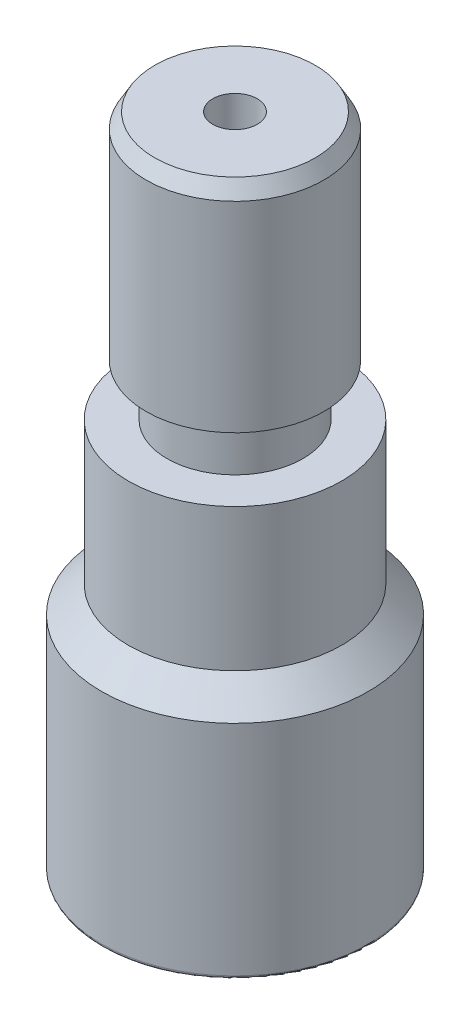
ISO-10303-21;
HEADER;
FILE_DESCRIPTION(('STEP AP214'),'2;1');
FILE_NAME('part.step','',(''),(''),'','','');
FILE_SCHEMA(('AUTOMOTIVE_DESIGN { 1 0 10303 214 1 1 1 1 }'));
ENDSEC;
DATA;
#1=APPLICATION_CONTEXT('core data for automotive mechanical design processes');
#2=APPLICATION_PROTOCOL_DEFINITION('international standard','automotive_design',2000,#1);
#3=PRODUCT_CONTEXT('',#1,'mechanical');
#4=PRODUCT('Part','Part','',(#3));
#5=PRODUCT_RELATED_PRODUCT_CATEGORY('part','',(#4));
#6=PRODUCT_DEFINITION_FORMATION('','',#4);
#7=PRODUCT_DEFINITION_CONTEXT('part definition',#1,'design');
#8=PRODUCT_DEFINITION('design','',#6,#7);
#9=PRODUCT_DEFINITION_SHAPE('','',#8);
#10=(LENGTH_UNIT() NAMED_UNIT(*) SI_UNIT(.MILLI.,.METRE.));
#11=(NAMED_UNIT(*) PLANE_ANGLE_UNIT() SI_UNIT($,.RADIAN.));
#12=(NAMED_UNIT(*) SI_UNIT($,.STERADIAN.) SOLID_ANGLE_UNIT());
#13=UNCERTAINTY_MEASURE_WITH_UNIT(LENGTH_MEASURE(1.E-05),#10,'distance_accuracy_value','');
#14=(GEOMETRIC_REPRESENTATION_CONTEXT(3) GLOBAL_UNCERTAINTY_ASSIGNED_CONTEXT((#13)) GLOBAL_UNIT_ASSIGNED_CONTEXT((#10,
#11,#12)) REPRESENTATION_CONTEXT('',''));
#15=CARTESIAN_POINT('',(0.,0.,0.));
#16=DIRECTION('',(0.,0.,1.));
#17=DIRECTION('',(1.,0.,0.));
#18=AXIS2_PLACEMENT_3D('',#15,#16,#17);
#19=CARTESIAN_POINT('',(0.,8.89,0.));
#20=DIRECTION('',(0.,-1.,0.));
#21=DIRECTION('',(0.,0.,-1.));
#22=AXIS2_PLACEMENT_3D('',#19,#20,#21);
#23=CYLINDRICAL_SURFACE('',#22,4.7625);
#24=CARTESIAN_POINT('',(0.,0.127,0.));
#25=DIRECTION('',(0.,1.,0.));
#26=DIRECTION('',(0.,0.,1.));
#27=AXIS2_PLACEMENT_3D('',#24,#25,#26);
#28=CIRCLE('',#27,4.7625);
#29=CARTESIAN_POINT('',(0.,0.127,4.7625));
#30=VERTEX_POINT('',#29);
#31=EDGE_CURVE('E38',#30,#30,#28,.T.);
#32=ORIENTED_EDGE('',*,*,#31,.T.);
#33=EDGE_LOOP('',(#32));
#34=FACE_BOUND('',#33,.T.);
#35=CARTESIAN_POINT('',(0.,7.93750000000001,0.));
#36=DIRECTION('',(0.,1.,0.));
#37=DIRECTION('',(0.,0.,1.));
#38=AXIS2_PLACEMENT_3D('',#35,#36,#37);
#39=CIRCLE('',#38,4.7625);
#40=CARTESIAN_POINT('',(0.,7.93750000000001,4.7625));
#41=VERTEX_POINT('',#40);
#42=EDGE_CURVE('E81',#41,#41,#39,.T.);
#43=ORIENTED_EDGE('',*,*,#42,.F.);
#44=EDGE_LOOP('',(#43));
#45=FACE_BOUND('',#44,.T.);
#46=ADVANCED_FACE('F32',(#34,#45),#23,.T.);
#47=CARTESIAN_POINT('',(0.,23.495,0.));
#48=DIRECTION('',(0.,1.,0.));
#49=DIRECTION('',(0.,0.,1.));
#50=AXIS2_PLACEMENT_3D('',#47,#48,#49);
#51=PLANE('',#50);
#52=CARTESIAN_POINT('',(0.,23.495,0.));
#53=DIRECTION('',(0.,1.,0.));
#54=DIRECTION('',(0.,0.,1.));
#55=AXIS2_PLACEMENT_3D('',#52,#53,#54);
#56=CIRCLE('',#55,2.86704136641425);
#57=CARTESIAN_POINT('',(0.,23.495,2.86704136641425));
#58=VERTEX_POINT('',#57);
#59=EDGE_CURVE('E42',#58,#58,#56,.T.);
#60=ORIENTED_EDGE('',*,*,#59,.T.);
#61=EDGE_LOOP('',(#60));
#62=FACE_BOUND('',#61,.T.);
#63=CARTESIAN_POINT('',(0.,23.495,0.));
#64=DIRECTION('',(0.,-1.,0.));
#65=DIRECTION('',(0.,0.,-1.));
#66=AXIS2_PLACEMENT_3D('',#63,#64,#65);
#67=CIRCLE('',#66,0.793749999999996);
#68=CARTESIAN_POINT('',(0.,23.495,-0.793749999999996));
#69=VERTEX_POINT('',#68);
#70=EDGE_CURVE('E78',#69,#69,#67,.T.);
#71=ORIENTED_EDGE('',*,*,#70,.T.);
#72=EDGE_LOOP('',(#71));
#73=FACE_BOUND('',#72,.T.);
#74=ADVANCED_FACE('F102',(#62,#73),#51,.T.);
#75=CARTESIAN_POINT('',(0.,0.,0.));
#76=DIRECTION('',(0.,1.,0.));
#77=DIRECTION('',(0.,0.,1.));
#78=AXIS2_PLACEMENT_3D('',#75,#76,#77);
#79=PLANE('',#78);
#80=CARTESIAN_POINT('',(0.,0.,0.));
#81=DIRECTION('',(0.,1.,0.));
#82=DIRECTION('',(0.,0.,1.));
#83=AXIS2_PLACEMENT_3D('',#80,#81,#82);
#84=CIRCLE('',#83,4.6355);
#85=CARTESIAN_POINT('',(0.,0.,4.6355));
#86=VERTEX_POINT('',#85);
#87=EDGE_CURVE('E10',#86,#86,#84,.F.);
#88=ORIENTED_EDGE('',*,*,#87,.T.);
#89=EDGE_LOOP('',(#88));
#90=FACE_BOUND('',#89,.T.);
#91=CARTESIAN_POINT('',(0.,0.,0.));
#92=DIRECTION('',(0.,-1.,0.));
#93=DIRECTION('',(0.,0.,-1.));
#94=AXIS2_PLACEMENT_3D('',#91,#92,#93);
#95=CIRCLE('',#94,3.42899703);
#96=CARTESIAN_POINT('',(0.,0.,-3.42899703));
#97=VERTEX_POINT('',#96);
#98=EDGE_CURVE('E66',#97,#97,#95,.T.);
#99=ORIENTED_EDGE('',*,*,#98,.F.);
#100=EDGE_LOOP('',(#99));
#101=FACE_BOUND('',#100,.T.);
#102=ADVANCED_FACE('F106',(#90,#101),#79,.F.);
#103=CARTESIAN_POINT('',(0.,13.97,0.));
#104=DIRECTION('',(0.,1.,0.));
#105=DIRECTION('',(0.,0.,1.));
#106=AXIS2_PLACEMENT_3D('',#103,#104,#105);
#107=PLANE('',#106);
#108=CARTESIAN_POINT('',(0.,13.97,0.));
#109=DIRECTION('',(0.,1.,0.));
#110=DIRECTION('',(0.,0.,1.));
#111=AXIS2_PLACEMENT_3D('',#108,#109,#110);
#112=CIRCLE('',#111,3.81);
#113=CARTESIAN_POINT('',(0.,13.97,3.81));
#114=VERTEX_POINT('',#113);
#115=EDGE_CURVE('E57',#114,#114,#112,.T.);
#116=ORIENTED_EDGE('',*,*,#115,.T.);
#117=EDGE_LOOP('',(#116));
#118=FACE_BOUND('',#117,.T.);
#119=CARTESIAN_POINT('',(0.,13.97,0.));
#120=DIRECTION('',(0.,1.,0.));
#121=DIRECTION('',(0.,0.,1.));
#122=AXIS2_PLACEMENT_3D('',#119,#120,#121);
#123=CIRCLE('',#122,2.4257);
#124=CARTESIAN_POINT('',(0.,13.97,-2.4257));
#125=VERTEX_POINT('',#124);
#126=EDGE_CURVE('E63',#125,#125,#123,.T.);
#127=ORIENTED_EDGE('',*,*,#126,.F.);
#128=EDGE_LOOP('',(#127));
#129=FACE_BOUND('',#128,.T.);
#130=ADVANCED_FACE('F114',(#118,#129),#107,.T.);
#131=CARTESIAN_POINT('',(0.,13.97,0.));
#132=DIRECTION('',(0.,-1.,0.));
#133=DIRECTION('',(0.,0.,-1.));
#134=AXIS2_PLACEMENT_3D('',#131,#132,#133);
#135=CYLINDRICAL_SURFACE('',#134,3.81);
#136=ORIENTED_EDGE('',*,*,#115,.F.);
#137=EDGE_LOOP('',(#136));
#138=FACE_BOUND('',#137,.T.);
#139=CARTESIAN_POINT('',(0.,8.89,0.));
#140=DIRECTION('',(0.,1.,0.));
#141=DIRECTION('',(0.,0.,1.));
#142=AXIS2_PLACEMENT_3D('',#139,#140,#141);
#143=CIRCLE('',#142,3.81);
#144=CARTESIAN_POINT('',(0.,8.89,3.81));
#145=VERTEX_POINT('',#144);
#146=EDGE_CURVE('E84',#145,#145,#143,.T.);
#147=ORIENTED_EDGE('',*,*,#146,.T.);
#148=EDGE_LOOP('',(#147));
#149=FACE_BOUND('',#148,.T.);
#150=ADVANCED_FACE('F88',(#138,#149),#135,.T.);
#151=CARTESIAN_POINT('',(0.,15.494,0.));
#152=DIRECTION('',(0.,-1.,0.));
#153=DIRECTION('',(0.,0.,-1.));
#154=AXIS2_PLACEMENT_3D('',#151,#152,#153);
#155=CYLINDRICAL_SURFACE('',#154,2.4257);
#156=CARTESIAN_POINT('',(0.,15.494,0.));
#157=DIRECTION('',(0.,1.,0.));
#158=DIRECTION('',(0.,0.,1.));
#159=AXIS2_PLACEMENT_3D('',#156,#157,#158);
#160=CIRCLE('',#159,2.4257);
#161=CARTESIAN_POINT('',(0.,15.494,-2.4257));
#162=VERTEX_POINT('',#161);
#163=EDGE_CURVE('E60',#162,#162,#160,.T.);
#164=CARTESIAN_POINT('',(0.,15.494,-2.4257));
#165=CARTESIAN_POINT('',(0.,15.478125,-2.4257));
#166=CARTESIAN_POINT('',(0.,15.46225,-2.4257));
#167=CARTESIAN_POINT('',(0.,15.4305,-2.4257));
#168=CARTESIAN_POINT('',(0.,15.414625,-2.4257));
#169=CARTESIAN_POINT('',(0.,15.382875,-2.4257));
#170=CARTESIAN_POINT('',(0.,15.367,-2.4257));
#171=CARTESIAN_POINT('',(0.,15.33525,-2.4257));
#172=CARTESIAN_POINT('',(0.,15.319375,-2.4257));
#173=CARTESIAN_POINT('',(0.,15.287625,-2.4257));
#174=CARTESIAN_POINT('',(0.,15.27175,-2.4257));
#175=CARTESIAN_POINT('',(0.,15.24,-2.4257));
#176=CARTESIAN_POINT('',(0.,15.224125,-2.4257));
#177=CARTESIAN_POINT('',(0.,15.192375,-2.4257));
#178=CARTESIAN_POINT('',(0.,15.1765,-2.4257));
#179=CARTESIAN_POINT('',(0.,15.14475,-2.4257));
#180=CARTESIAN_POINT('',(0.,15.128875,-2.4257));
#181=CARTESIAN_POINT('',(0.,15.097125,-2.4257));
#182=CARTESIAN_POINT('',(0.,15.08125,-2.4257));
#183=CARTESIAN_POINT('',(0.,15.0495,-2.4257));
#184=CARTESIAN_POINT('',(0.,15.033625,-2.4257));
#185=CARTESIAN_POINT('',(0.,15.001875,-2.4257));
#186=CARTESIAN_POINT('',(0.,14.986,-2.4257));
#187=CARTESIAN_POINT('',(0.,14.95425,-2.4257));
#188=CARTESIAN_POINT('',(0.,14.938375,-2.4257));
#189=CARTESIAN_POINT('',(0.,14.906625,-2.4257));
#190=CARTESIAN_POINT('',(0.,14.89075,-2.4257));
#191=CARTESIAN_POINT('',(0.,14.859,-2.4257));
#192=CARTESIAN_POINT('',(0.,14.843125,-2.4257));
#193=CARTESIAN_POINT('',(0.,14.811375,-2.4257));
#194=CARTESIAN_POINT('',(0.,14.7955,-2.4257));
#195=CARTESIAN_POINT('',(0.,14.76375,-2.4257));
#196=CARTESIAN_POINT('',(0.,14.747875,-2.4257));
#197=CARTESIAN_POINT('',(0.,14.716125,-2.4257));
#198=CARTESIAN_POINT('',(0.,14.70025,-2.4257));
#199=CARTESIAN_POINT('',(0.,14.6685,-2.4257));
#200=CARTESIAN_POINT('',(0.,14.652625,-2.4257));
#201=CARTESIAN_POINT('',(0.,14.620875,-2.4257));
#202=CARTESIAN_POINT('',(0.,14.605,-2.4257));
#203=CARTESIAN_POINT('',(0.,14.57325,-2.4257));
#204=CARTESIAN_POINT('',(0.,14.557375,-2.4257));
#205=CARTESIAN_POINT('',(0.,14.525625,-2.4257));
#206=CARTESIAN_POINT('',(0.,14.50975,-2.4257));
#207=CARTESIAN_POINT('',(0.,14.478,-2.4257));
#208=CARTESIAN_POINT('',(0.,14.462125,-2.4257));
#209=CARTESIAN_POINT('',(0.,14.430375,-2.4257));
#210=CARTESIAN_POINT('',(0.,14.4145,-2.4257));
#211=CARTESIAN_POINT('',(0.,14.38275,-2.4257));
#212=CARTESIAN_POINT('',(0.,14.366875,-2.4257));
#213=CARTESIAN_POINT('',(0.,14.335125,-2.4257));
#214=CARTESIAN_POINT('',(0.,14.31925,-2.4257));
#215=CARTESIAN_POINT('',(0.,14.2875,-2.4257));
#216=CARTESIAN_POINT('',(0.,14.271625,-2.4257));
#217=CARTESIAN_POINT('',(0.,14.239875,-2.4257));
#218=CARTESIAN_POINT('',(0.,14.224,-2.4257));
#219=CARTESIAN_POINT('',(0.,14.19225,-2.4257));
#220=CARTESIAN_POINT('',(0.,14.176375,-2.4257));
#221=CARTESIAN_POINT('',(0.,14.144625,-2.4257));
#222=CARTESIAN_POINT('',(0.,14.12875,-2.4257));
#223=CARTESIAN_POINT('',(0.,14.097,-2.4257));
#224=CARTESIAN_POINT('',(0.,14.081125,-2.4257));
#225=CARTESIAN_POINT('',(0.,14.049375,-2.4257));
#226=CARTESIAN_POINT('',(0.,14.0335,-2.4257));
#227=CARTESIAN_POINT('',(0.,14.00175,-2.4257));
#228=CARTESIAN_POINT('',(0.,13.985875,-2.4257));
#229=CARTESIAN_POINT('',(0.,13.97,-2.4257));
#230=B_SPLINE_CURVE_WITH_KNOTS('',3,(#164,#165,#166,#167,#168,#169,#170,#171,#172,#173,#174,
#175,#176,#177,#178,#179,#180,#181,#182,#183,#184,#185,#186,#187,#188,#189,#190,#191,#192,#193,
#194,#195,#196,#197,#198,#199,#200,#201,#202,#203,#204,#205,#206,#207,#208,#209,#210,#211,#212,
#213,#214,#215,#216,#217,#218,#219,#220,#221,#222,#223,#224,#225,#226,#227,#228,#229),
.UNSPECIFIED.,.F.,.F.,(4,2,2,2,2,2,2,2,2,2,2,2,2,2,2,2,2,2,2,2,2,2,2,2,2,2,2,2,2,2,2,2,4),(0.,
0.0476249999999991,0.0952499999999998,0.142874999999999,0.1905,0.238124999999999,0.28575,
0.333374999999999,0.380999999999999,0.428624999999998,0.476249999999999,0.523874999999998,
0.571499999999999,0.619124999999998,0.666749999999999,0.714375,0.761999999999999,0.809625,
0.857249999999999,0.904874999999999,0.952499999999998,1.000125,1.04775,1.095375,1.143,1.190625,
1.23825,1.285875,1.3335,1.381125,1.42875,1.476375,1.524),.UNSPECIFIED.);
#231=EDGE_CURVE('BSEAM125',#162,#125,#230,.T.);
#232=ORIENTED_EDGE('',*,*,#163,.F.);
#233=ORIENTED_EDGE('',*,*,#126,.T.);
#234=ORIENTED_EDGE('',*,*,#231,.T.);
#235=ORIENTED_EDGE('',*,*,#231,.F.);
#236=EDGE_LOOP('',(#232,#234,#233,#235));
#237=FACE_BOUND('',#236,.T.);
#238=ADVANCED_FACE('F125',(#237),#155,.T.);
#239=CARTESIAN_POINT('',(0.,15.494,0.));
#240=DIRECTION('',(0.,1.,0.));
#241=DIRECTION('',(0.,0.,1.));
#242=AXIS2_PLACEMENT_3D('',#239,#240,#241);
#243=PLANE('',#242);
#244=CARTESIAN_POINT('',(0.,15.494,0.));
#245=DIRECTION('',(0.,1.,0.));
#246=DIRECTION('',(0.,0.,1.));
#247=AXIS2_PLACEMENT_3D('',#244,#245,#246);
#248=CIRCLE('',#247,2.6416);
#249=CARTESIAN_POINT('',(0.,15.494,2.6416));
#250=VERTEX_POINT('',#249);
#251=EDGE_CURVE('E46',#250,#250,#248,.F.);
#252=ORIENTED_EDGE('',*,*,#251,.T.);
#253=EDGE_LOOP('',(#252));
#254=FACE_BOUND('',#253,.T.);
#255=ORIENTED_EDGE('',*,*,#163,.T.);
#256=EDGE_LOOP('',(#255));
#257=FACE_BOUND('',#256,.T.);
#258=ADVANCED_FACE('F118',(#254,#257),#243,.F.);
#259=CARTESIAN_POINT('',(0.,23.495,0.));
#260=DIRECTION('',(0.,-1.,0.));
#261=DIRECTION('',(0.,0.,-1.));
#262=AXIS2_PLACEMENT_3D('',#259,#260,#261);
#263=CYLINDRICAL_SURFACE('',#262,3.175);
#264=CARTESIAN_POINT('',(0.,15.8019586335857,0.));
#265=DIRECTION('',(0.,1.,0.));
#266=DIRECTION('',(0.,0.,1.));
#267=AXIS2_PLACEMENT_3D('',#264,#265,#266);
#268=CIRCLE('',#267,3.175);
#269=CARTESIAN_POINT('',(0.,15.8019586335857,3.175));
#270=VERTEX_POINT('',#269);
#271=EDGE_CURVE('E51',#270,#270,#268,.T.);
#272=ORIENTED_EDGE('',*,*,#271,.T.);
#273=EDGE_LOOP('',(#272));
#274=FACE_BOUND('',#273,.T.);
#275=CARTESIAN_POINT('',(0.,22.9616,0.));
#276=DIRECTION('',(0.,1.,0.));
#277=DIRECTION('',(0.,0.,1.));
#278=AXIS2_PLACEMENT_3D('',#275,#276,#277);
#279=CIRCLE('',#278,3.175);
#280=CARTESIAN_POINT('',(0.,22.9616,3.175));
#281=VERTEX_POINT('',#280);
#282=EDGE_CURVE('E54',#281,#281,#279,.F.);
#283=ORIENTED_EDGE('',*,*,#282,.T.);
#284=EDGE_LOOP('',(#283));
#285=FACE_BOUND('',#284,.T.);
#286=ADVANCED_FACE('F120',(#274,#285),#263,.T.);
#287=CARTESIAN_POINT('',(0.,0.723897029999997,0.));
#288=DIRECTION('',(0.,-1.,0.));
#289=DIRECTION('',(0.,0.,-1.));
#290=AXIS2_PLACEMENT_3D('',#287,#288,#289);
#291=CONICAL_SURFACE('',#290,2.7051,0.785398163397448);
#292=ORIENTED_EDGE('',*,*,#98,.T.);
#293=EDGE_LOOP('',(#292));
#294=FACE_BOUND('',#293,.T.);
#295=CARTESIAN_POINT('',(0.,0.723897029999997,0.));
#296=DIRECTION('',(0.,-1.,0.));
#297=DIRECTION('',(0.,0.,-1.));
#298=AXIS2_PLACEMENT_3D('',#295,#296,#297);
#299=CIRCLE('',#298,2.7051);
#300=CARTESIAN_POINT('',(0.,0.723897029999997,-2.7051));
#301=VERTEX_POINT('',#300);
#302=EDGE_CURVE('E69',#301,#301,#299,.T.);
#303=ORIENTED_EDGE('',*,*,#302,.F.);
#304=EDGE_LOOP('',(#303));
#305=FACE_BOUND('',#304,.T.);
#306=ADVANCED_FACE('F123',(#294,#305),#291,.F.);
#307=CARTESIAN_POINT('',(0.,1.70530256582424E-10,0.));
#308=DIRECTION('',(0.,-1.,0.));
#309=DIRECTION('',(0.,0.,-1.));
#310=AXIS2_PLACEMENT_3D('',#307,#308,#309);
#311=CYLINDRICAL_SURFACE('',#310,2.7051);
#312=ORIENTED_EDGE('',*,*,#302,.T.);
#313=EDGE_LOOP('',(#312));
#314=FACE_BOUND('',#313,.T.);
#315=CARTESIAN_POINT('',(0.,5.8928,0.));
#316=DIRECTION('',(0.,-1.,0.));
#317=DIRECTION('',(0.,0.,-1.));
#318=AXIS2_PLACEMENT_3D('',#315,#316,#317);
#319=CIRCLE('',#318,2.7051);
#320=CARTESIAN_POINT('',(0.,5.8928,-2.7051));
#321=VERTEX_POINT('',#320);
#322=EDGE_CURVE('E72',#321,#321,#319,.T.);
#323=ORIENTED_EDGE('',*,*,#322,.F.);
#324=EDGE_LOOP('',(#323));
#325=FACE_BOUND('',#324,.T.);
#326=ADVANCED_FACE('F163',(#314,#325),#311,.F.);
#327=CARTESIAN_POINT('',(0.,5.8928,0.));
#328=DIRECTION('',(0.,-1.,0.));
#329=DIRECTION('',(0.,0.,-1.));
#330=AXIS2_PLACEMENT_3D('',#327,#328,#329);
#331=PLANE('',#330);
#332=CARTESIAN_POINT('',(0.,5.8928,0.));
#333=DIRECTION('',(0.,-1.,0.));
#334=DIRECTION('',(0.,0.,-1.));
#335=AXIS2_PLACEMENT_3D('',#332,#333,#334);
#336=CIRCLE('',#335,0.793749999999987);
#337=CARTESIAN_POINT('',(0.,5.8928,-0.793749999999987));
#338=VERTEX_POINT('',#337);
#339=EDGE_CURVE('E75',#338,#338,#336,.T.);
#340=ORIENTED_EDGE('',*,*,#339,.F.);
#341=EDGE_LOOP('',(#340));
#342=FACE_BOUND('',#341,.T.);
#343=ORIENTED_EDGE('',*,*,#322,.T.);
#344=EDGE_LOOP('',(#343));
#345=FACE_BOUND('',#344,.T.);
#346=ADVANCED_FACE('F171',(#342,#345),#331,.T.);
#347=CARTESIAN_POINT('',(0.,5.8928,0.));
#348=DIRECTION('',(0.,-1.,0.));
#349=DIRECTION('',(0.,0.,-1.));
#350=AXIS2_PLACEMENT_3D('',#347,#348,#349);
#351=CYLINDRICAL_SURFACE('',#350,0.793749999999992);
#352=ORIENTED_EDGE('',*,*,#70,.F.);
#353=EDGE_LOOP('',(#352));
#354=FACE_BOUND('',#353,.T.);
#355=ORIENTED_EDGE('',*,*,#339,.T.);
#356=EDGE_LOOP('',(#355));
#357=FACE_BOUND('',#356,.T.);
#358=ADVANCED_FACE('F178',(#354,#357),#351,.F.);
#359=CARTESIAN_POINT('',(0.,15.8019586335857,0.));
#360=DIRECTION('',(0.,1.,0.));
#361=DIRECTION('',(0.,0.,1.));
#362=AXIS2_PLACEMENT_3D('',#359,#360,#361);
#363=CONICAL_SURFACE('',#362,3.175,1.0471975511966);
#364=CARTESIAN_POINT('',(0.,15.494,2.6416));
#365=CARTESIAN_POINT('',(0.,15.4972079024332,2.64715625));
#366=CARTESIAN_POINT('',(0.,15.5004158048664,2.6527125));
#367=CARTESIAN_POINT('',(0.,15.5068316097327,2.663825));
#368=CARTESIAN_POINT('',(0.,15.5100395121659,2.66938125));
#369=CARTESIAN_POINT('',(0.,15.5164553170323,2.68049375));
#370=CARTESIAN_POINT('',(0.,15.5196632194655,2.68605));
#371=CARTESIAN_POINT('',(0.,15.5260790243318,2.6971625));
#372=CARTESIAN_POINT('',(0.,15.529286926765,2.70271875));
#373=CARTESIAN_POINT('',(0.,15.5357027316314,2.71383125));
#374=CARTESIAN_POINT('',(0.,15.5389106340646,2.7193875));
#375=CARTESIAN_POINT('',(0.,15.545326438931,2.7305));
#376=CARTESIAN_POINT('',(0.,15.5485343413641,2.73605625));
#377=CARTESIAN_POINT('',(0.,15.5549501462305,2.74716875));
#378=CARTESIAN_POINT('',(0.,15.5581580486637,2.752725));
#379=CARTESIAN_POINT('',(0.,15.5645738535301,2.7638375));
#380=CARTESIAN_POINT('',(0.,15.5677817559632,2.76939375));
#381=CARTESIAN_POINT('',(0.,15.5741975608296,2.78050625));
#382=CARTESIAN_POINT('',(0.,15.5774054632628,2.7860625));
#383=CARTESIAN_POINT('',(0.,15.5838212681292,2.797175));
#384=CARTESIAN_POINT('',(0.,15.5870291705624,2.80273125));
#385=CARTESIAN_POINT('',(0.,15.5934449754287,2.81384375));
#386=CARTESIAN_POINT('',(0.,15.5966528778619,2.8194));
#387=CARTESIAN_POINT('',(0.,15.6030686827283,2.8305125));
#388=CARTESIAN_POINT('',(0.,15.6062765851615,2.83606875));
#389=CARTESIAN_POINT('',(0.,15.6126923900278,2.84718125));
#390=CARTESIAN_POINT('',(0.,15.615900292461,2.8527375));
#391=CARTESIAN_POINT('',(0.,15.6223160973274,2.86385));
#392=CARTESIAN_POINT('',(0.,15.6255239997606,2.86940625));
#393=CARTESIAN_POINT('',(0.,15.6319398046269,2.88051875));
#394=CARTESIAN_POINT('',(0.,15.6351477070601,2.886075));
#395=CARTESIAN_POINT('',(0.,15.6415635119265,2.8971875));
#396=CARTESIAN_POINT('',(0.,15.6447714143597,2.90274375));
#397=CARTESIAN_POINT('',(0.,15.6511872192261,2.91385625));
#398=CARTESIAN_POINT('',(0.,15.6543951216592,2.9194125));
#399=CARTESIAN_POINT('',(0.,15.6608109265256,2.930525));
#400=CARTESIAN_POINT('',(0.,15.6640188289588,2.93608125));
#401=CARTESIAN_POINT('',(0.,15.6704346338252,2.94719375));
#402=CARTESIAN_POINT('',(0.,15.6736425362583,2.95275));
#403=CARTESIAN_POINT('',(0.,15.6800583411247,2.9638625));
#404=CARTESIAN_POINT('',(0.,15.6832662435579,2.96941875));
#405=CARTESIAN_POINT('',(0.,15.6896820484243,2.98053125));
#406=CARTESIAN_POINT('',(0.,15.6928899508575,2.9860875));
#407=CARTESIAN_POINT('',(0.,15.6993057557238,2.9972));
#408=CARTESIAN_POINT('',(0.,15.702513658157,3.00275625));
#409=CARTESIAN_POINT('',(0.,15.7089294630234,3.01386875));
#410=CARTESIAN_POINT('',(0.,15.7121373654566,3.019425));
#411=CARTESIAN_POINT('',(0.,15.7185531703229,3.0305375));
#412=CARTESIAN_POINT('',(0.,15.7217610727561,3.03609375));
#413=CARTESIAN_POINT('',(0.,15.7281768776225,3.04720625));
#414=CARTESIAN_POINT('',(0.,15.7313847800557,3.0527625));
#415=CARTESIAN_POINT('',(0.,15.737800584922,3.063875));
#416=CARTESIAN_POINT('',(0.,15.7410084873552,3.06943125));
#417=CARTESIAN_POINT('',(0.,15.7474242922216,3.08054375));
#418=CARTESIAN_POINT('',(0.,15.7506321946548,3.0861));
#419=CARTESIAN_POINT('',(0.,15.7570479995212,3.0972125));
#420=CARTESIAN_POINT('',(0.,15.7602559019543,3.10276875));
#421=CARTESIAN_POINT('',(0.,15.7666717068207,3.11388125));
#422=CARTESIAN_POINT('',(0.,15.7698796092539,3.1194375));
#423=CARTESIAN_POINT('',(0.,15.7762954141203,3.13055));
#424=CARTESIAN_POINT('',(0.,15.7795033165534,3.13610625));
#425=CARTESIAN_POINT('',(0.,15.7859191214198,3.14721875));
#426=CARTESIAN_POINT('',(0.,15.789127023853,3.152775));
#427=CARTESIAN_POINT('',(0.,15.7955428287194,3.1638875));
#428=CARTESIAN_POINT('',(0.,15.7987507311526,3.16944375));
#429=CARTESIAN_POINT('',(0.,15.8019586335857,3.175));
#430=B_SPLINE_CURVE_WITH_KNOTS('',3,(#364,#365,#366,#367,#368,#369,#370,#371,#372,#373,#374,
#375,#376,#377,#378,#379,#380,#381,#382,#383,#384,#385,#386,#387,#388,#389,#390,#391,#392,#393,
#394,#395,#396,#397,#398,#399,#400,#401,#402,#403,#404,#405,#406,#407,#408,#409,#410,#411,#412,
#413,#414,#415,#416,#417,#418,#419,#420,#421,#422,#423,#424,#425,#426,#427,#428,#429),
.UNSPECIFIED.,.F.,.F.,(4,2,2,2,2,2,2,2,2,2,2,2,2,2,2,2,2,2,2,2,2,2,2,2,2,2,2,2,2,2,2,2,4),(0.,
0.0192474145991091,0.0384948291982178,0.0577422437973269,0.076989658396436,0.0962370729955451,
0.115484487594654,0.134731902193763,0.153979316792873,0.173226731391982,0.192474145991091,
0.2117215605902,0.230968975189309,0.250216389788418,0.269463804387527,0.288711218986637,
0.307958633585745,0.327206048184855,0.346453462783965,0.365700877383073,0.384948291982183,
0.404195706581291,0.423443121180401,0.442690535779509,0.461937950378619,0.481185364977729,
0.500432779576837,0.519680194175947,0.538927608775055,0.558175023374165,0.577422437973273,
0.596669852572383,0.615917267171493),.UNSPECIFIED.);
#431=EDGE_CURVE('BSEAM186',#250,#270,#430,.T.);
#432=ORIENTED_EDGE('',*,*,#251,.F.);
#433=ORIENTED_EDGE('',*,*,#271,.F.);
#434=ORIENTED_EDGE('',*,*,#431,.T.);
#435=ORIENTED_EDGE('',*,*,#431,.F.);
#436=EDGE_LOOP('',(#432,#434,#433,#435));
#437=FACE_BOUND('',#436,.T.);
#438=ADVANCED_FACE('F186',(#437),#363,.T.);
#439=CARTESIAN_POINT('',(0.,23.495,0.));
#440=DIRECTION('',(0.,-1.,0.));
#441=DIRECTION('',(0.,0.,-1.));
#442=AXIS2_PLACEMENT_3D('',#439,#440,#441);
#443=CONICAL_SURFACE('',#442,2.86704136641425,0.523598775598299);
#444=ORIENTED_EDGE('',*,*,#282,.F.);
#445=EDGE_LOOP('',(#444));
#446=FACE_BOUND('',#445,.T.);
#447=ORIENTED_EDGE('',*,*,#59,.F.);
#448=EDGE_LOOP('',(#447));
#449=FACE_BOUND('',#448,.T.);
#450=ADVANCED_FACE('F98',(#446,#449),#443,.T.);
#451=CARTESIAN_POINT('',(0.,0.127,0.));
#452=DIRECTION('',(0.,1.,0.));
#453=DIRECTION('',(0.,0.,1.));
#454=AXIS2_PLACEMENT_3D('',#451,#452,#453);
#455=TOROIDAL_SURFACE('',#454,4.6355,0.127);
#456=ORIENTED_EDGE('',*,*,#87,.F.);
#457=EDGE_LOOP('',(#456));
#458=FACE_BOUND('',#457,.T.);
#459=ORIENTED_EDGE('',*,*,#31,.F.);
#460=EDGE_LOOP('',(#459));
#461=FACE_BOUND('',#460,.T.);
#462=ADVANCED_FACE('F92',(#458,#461),#455,.T.);
#463=CARTESIAN_POINT('',(0.,8.89,0.));
#464=DIRECTION('',(0.,-1.,0.));
#465=DIRECTION('',(0.,0.,-1.));
#466=AXIS2_PLACEMENT_3D('',#463,#464,#465);
#467=CONICAL_SURFACE('',#466,3.81,0.785398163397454);
#468=ORIENTED_EDGE('',*,*,#42,.T.);
#469=EDGE_LOOP('',(#468));
#470=FACE_BOUND('',#469,.T.);
#471=ORIENTED_EDGE('',*,*,#146,.F.);
#472=EDGE_LOOP('',(#471));
#473=FACE_BOUND('',#472,.T.);
#474=ADVANCED_FACE('F90',(#470,#473),#467,.T.);
#475=CLOSED_SHELL('',(#46,#74,#102,#130,#150,#238,#258,#286,#306,#326,#346,#358,#438,#450,#462,#474));
#476=MANIFOLD_SOLID_BREP('B2',#475);
#477=ADVANCED_BREP_SHAPE_REPRESENTATION('',(#18,#476),#14);
#478=SHAPE_DEFINITION_REPRESENTATION(#9,#477);
ENDSEC;
END-ISO-10303-21;
